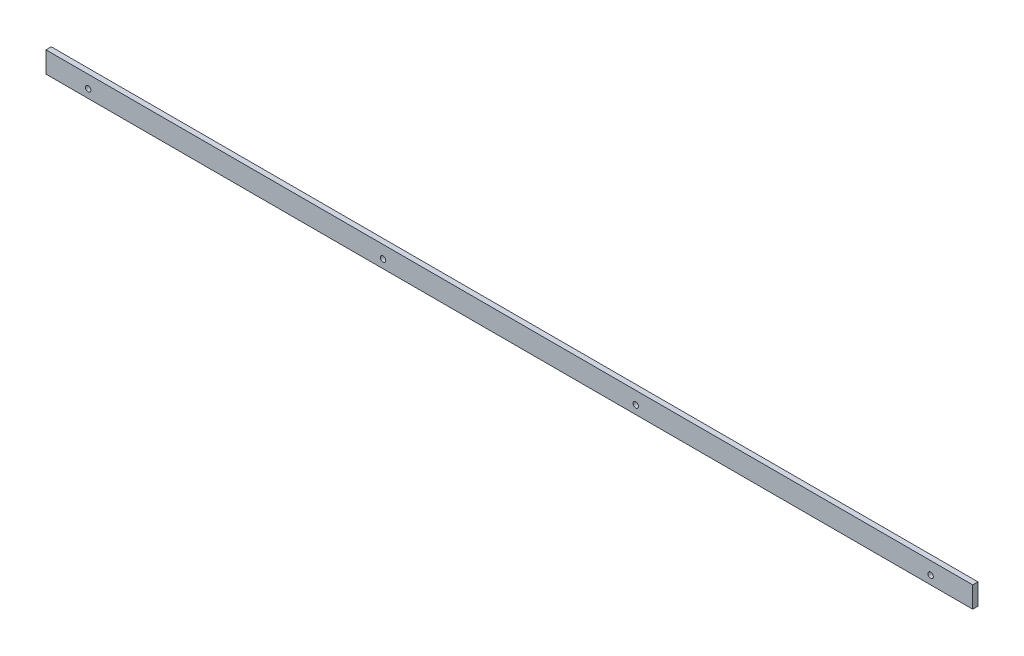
ISO-10303-21;
HEADER;
FILE_DESCRIPTION(('STEP AP214'),'2;1');
FILE_NAME('part.step','',(''),(''),'','','');
FILE_SCHEMA(('AUTOMOTIVE_DESIGN { 1 0 10303 214 1 1 1 1 }'));
ENDSEC;
DATA;
#1=APPLICATION_CONTEXT('core data for automotive mechanical design processes');
#2=APPLICATION_PROTOCOL_DEFINITION('international standard','automotive_design',2000,#1);
#3=PRODUCT_CONTEXT('',#1,'mechanical');
#4=PRODUCT('Part','Part','',(#3));
#5=PRODUCT_RELATED_PRODUCT_CATEGORY('part','',(#4));
#6=PRODUCT_DEFINITION_FORMATION('','',#4);
#7=PRODUCT_DEFINITION_CONTEXT('part definition',#1,'design');
#8=PRODUCT_DEFINITION('design','',#6,#7);
#9=PRODUCT_DEFINITION_SHAPE('','',#8);
#10=(LENGTH_UNIT() NAMED_UNIT(*) SI_UNIT(.MILLI.,.METRE.));
#11=(NAMED_UNIT(*) PLANE_ANGLE_UNIT() SI_UNIT($,.RADIAN.));
#12=(NAMED_UNIT(*) SI_UNIT($,.STERADIAN.) SOLID_ANGLE_UNIT());
#13=UNCERTAINTY_MEASURE_WITH_UNIT(LENGTH_MEASURE(1.E-05),#10,'distance_accuracy_value','');
#14=(GEOMETRIC_REPRESENTATION_CONTEXT(3) GLOBAL_UNCERTAINTY_ASSIGNED_CONTEXT((#13)) GLOBAL_UNIT_ASSIGNED_CONTEXT((#10,
#11,#12)) REPRESENTATION_CONTEXT('',''));
#15=CARTESIAN_POINT('',(0.,0.,0.));
#16=DIRECTION('',(0.,0.,1.));
#17=DIRECTION('',(1.,0.,0.));
#18=AXIS2_PLACEMENT_3D('',#15,#16,#17);
#19=CARTESIAN_POINT('',(-279.4,6.34999999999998,3.175));
#20=DIRECTION('',(1.,0.,0.));
#21=DIRECTION('',(0.,0.,-1.));
#22=AXIS2_PLACEMENT_3D('',#19,#20,#21);
#23=PLANE('',#22);
#24=DIRECTION('',(0.,-1.,0.));
#25=VECTOR('',#24,1.);
#26=CARTESIAN_POINT('',(-279.4,6.34999999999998,0.));
#27=LINE('',#26,#25);
#28=CARTESIAN_POINT('',(-279.4,6.34999999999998,0.));
#29=VERTEX_POINT('',#28);
#30=CARTESIAN_POINT('',(-279.4,-6.35000000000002,0.));
#31=VERTEX_POINT('',#30);
#32=EDGE_CURVE('E98',#29,#31,#27,.T.);
#33=ORIENTED_EDGE('',*,*,#32,.T.);
#34=DIRECTION('',(0.,0.,-1.));
#35=VECTOR('',#34,1.);
#36=CARTESIAN_POINT('',(-279.4,-6.35000000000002,3.175));
#37=LINE('',#36,#35);
#38=CARTESIAN_POINT('',(-279.4,-6.35000000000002,3.175));
#39=VERTEX_POINT('',#38);
#40=EDGE_CURVE('E11',#39,#31,#37,.T.);
#41=ORIENTED_EDGE('',*,*,#40,.F.);
#42=DIRECTION('',(0.,-1.,0.));
#43=VECTOR('',#42,1.);
#44=CARTESIAN_POINT('',(-279.4,6.34999999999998,3.175));
#45=LINE('',#44,#43);
#46=CARTESIAN_POINT('',(-279.4,6.34999999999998,3.175));
#47=VERTEX_POINT('',#46);
#48=EDGE_CURVE('E86',#47,#39,#45,.T.);
#49=ORIENTED_EDGE('',*,*,#48,.F.);
#50=DIRECTION('',(0.,0.,-1.));
#51=VECTOR('',#50,1.);
#52=CARTESIAN_POINT('',(-279.4,6.34999999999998,3.175));
#53=LINE('',#52,#51);
#54=EDGE_CURVE('E94',#47,#29,#53,.T.);
#55=ORIENTED_EDGE('',*,*,#54,.T.);
#56=EDGE_LOOP('',(#33,#41,#49,#55));
#57=FACE_BOUND('',#56,.T.);
#58=ADVANCED_FACE('F35',(#57),#23,.F.);
#59=CARTESIAN_POINT('',(-279.4,-6.35000000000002,3.175));
#60=DIRECTION('',(0.,1.,0.));
#61=DIRECTION('',(0.,0.,1.));
#62=AXIS2_PLACEMENT_3D('',#59,#60,#61);
#63=PLANE('',#62);
#64=DIRECTION('',(1.,0.,0.));
#65=VECTOR('',#64,1.);
#66=CARTESIAN_POINT('',(-279.4,-6.35000000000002,0.));
#67=LINE('',#66,#65);
#68=CARTESIAN_POINT('',(279.4,-6.35000000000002,0.));
#69=VERTEX_POINT('',#68);
#70=EDGE_CURVE('E90',#31,#69,#67,.T.);
#71=ORIENTED_EDGE('',*,*,#70,.T.);
#72=DIRECTION('',(0.,0.,-1.));
#73=VECTOR('',#72,1.);
#74=CARTESIAN_POINT('',(279.4,-6.35000000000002,3.175));
#75=LINE('',#74,#73);
#76=CARTESIAN_POINT('',(279.4,-6.35000000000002,3.175));
#77=VERTEX_POINT('',#76);
#78=EDGE_CURVE('E43',#77,#69,#75,.T.);
#79=ORIENTED_EDGE('',*,*,#78,.F.);
#80=DIRECTION('',(1.,0.,0.));
#81=VECTOR('',#80,1.);
#82=CARTESIAN_POINT('',(-279.4,-6.35000000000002,3.175));
#83=LINE('',#82,#81);
#84=EDGE_CURVE('E81',#39,#77,#83,.T.);
#85=ORIENTED_EDGE('',*,*,#84,.F.);
#86=ORIENTED_EDGE('',*,*,#40,.T.);
#87=EDGE_LOOP('',(#71,#79,#85,#86));
#88=FACE_BOUND('',#87,.T.);
#89=ADVANCED_FACE('F89',(#88),#63,.F.);
#90=CARTESIAN_POINT('',(279.4,6.34999999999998,3.175));
#91=DIRECTION('',(-1.,0.,0.));
#92=DIRECTION('',(0.,0.,1.));
#93=AXIS2_PLACEMENT_3D('',#90,#91,#92);
#94=PLANE('',#93);
#95=DIRECTION('',(0.,1.,0.));
#96=VECTOR('',#95,1.);
#97=CARTESIAN_POINT('',(279.4,6.34999999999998,0.));
#98=LINE('',#97,#96);
#99=CARTESIAN_POINT('',(279.4,6.34999999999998,0.));
#100=VERTEX_POINT('',#99);
#101=EDGE_CURVE('E68',#69,#100,#98,.T.);
#102=ORIENTED_EDGE('',*,*,#101,.T.);
#103=DIRECTION('',(0.,0.,-1.));
#104=VECTOR('',#103,1.);
#105=CARTESIAN_POINT('',(279.4,6.34999999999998,3.175));
#106=LINE('',#105,#104);
#107=CARTESIAN_POINT('',(279.4,6.34999999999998,3.175));
#108=VERTEX_POINT('',#107);
#109=EDGE_CURVE('E91',#108,#100,#106,.T.);
#110=ORIENTED_EDGE('',*,*,#109,.F.);
#111=DIRECTION('',(0.,1.,0.));
#112=VECTOR('',#111,1.);
#113=CARTESIAN_POINT('',(279.4,6.34999999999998,3.175));
#114=LINE('',#113,#112);
#115=EDGE_CURVE('E84',#77,#108,#114,.T.);
#116=ORIENTED_EDGE('',*,*,#115,.F.);
#117=ORIENTED_EDGE('',*,*,#78,.T.);
#118=EDGE_LOOP('',(#102,#110,#116,#117));
#119=FACE_BOUND('',#118,.T.);
#120=ADVANCED_FACE('F92',(#119),#94,.F.);
#121=CARTESIAN_POINT('',(-279.4,6.34999999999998,3.175));
#122=DIRECTION('',(0.,-1.,0.));
#123=DIRECTION('',(0.,0.,-1.));
#124=AXIS2_PLACEMENT_3D('',#121,#122,#123);
#125=PLANE('',#124);
#126=DIRECTION('',(-1.,0.,0.));
#127=VECTOR('',#126,1.);
#128=CARTESIAN_POINT('',(-279.4,6.34999999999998,0.));
#129=LINE('',#128,#127);
#130=EDGE_CURVE('E74',#100,#29,#129,.T.);
#131=ORIENTED_EDGE('',*,*,#130,.T.);
#132=ORIENTED_EDGE('',*,*,#54,.F.);
#133=DIRECTION('',(-1.,0.,0.));
#134=VECTOR('',#133,1.);
#135=CARTESIAN_POINT('',(-279.4,6.34999999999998,3.175));
#136=LINE('',#135,#134);
#137=EDGE_CURVE('E51',#108,#47,#136,.T.);
#138=ORIENTED_EDGE('',*,*,#137,.F.);
#139=ORIENTED_EDGE('',*,*,#109,.T.);
#140=EDGE_LOOP('',(#131,#132,#138,#139));
#141=FACE_BOUND('',#140,.T.);
#142=ADVANCED_FACE('F106',(#141),#125,.F.);
#143=CARTESIAN_POINT('',(0.,0.,3.175));
#144=DIRECTION('',(0.,0.,1.));
#145=DIRECTION('',(1.,0.,0.));
#146=AXIS2_PLACEMENT_3D('',#143,#144,#145);
#147=PLANE('',#146);
#148=CARTESIAN_POINT('',(-254.,-1.27000000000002,3.175));
#149=DIRECTION('',(0.,0.,1.));
#150=DIRECTION('',(1.,0.,0.));
#151=AXIS2_PLACEMENT_3D('',#148,#149,#150);
#152=CIRCLE('',#151,1.63194999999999);
#153=CARTESIAN_POINT('',(-252.36805,-1.27000000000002,3.175));
#154=VERTEX_POINT('',#153);
#155=EDGE_CURVE('E132',#154,#154,#152,.T.);
#156=ORIENTED_EDGE('',*,*,#155,.F.);
#157=EDGE_LOOP('',(#156));
#158=FACE_BOUND('',#157,.T.);
#159=CARTESIAN_POINT('',(-76.2,-1.27000000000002,3.175));
#160=DIRECTION('',(0.,0.,1.));
#161=DIRECTION('',(1.,0.,0.));
#162=AXIS2_PLACEMENT_3D('',#159,#160,#161);
#163=CIRCLE('',#162,1.63194999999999);
#164=CARTESIAN_POINT('',(-74.56805,-1.27000000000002,3.175));
#165=VERTEX_POINT('',#164);
#166=EDGE_CURVE('E126',#165,#165,#163,.T.);
#167=ORIENTED_EDGE('',*,*,#166,.F.);
#168=EDGE_LOOP('',(#167));
#169=FACE_BOUND('',#168,.T.);
#170=CARTESIAN_POINT('',(76.2,-1.27000000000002,3.175));
#171=DIRECTION('',(0.,0.,1.));
#172=DIRECTION('',(1.,0.,0.));
#173=AXIS2_PLACEMENT_3D('',#170,#171,#172);
#174=CIRCLE('',#173,1.63194999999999);
#175=CARTESIAN_POINT('',(77.83195,-1.27000000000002,3.175));
#176=VERTEX_POINT('',#175);
#177=EDGE_CURVE('E120',#176,#176,#174,.T.);
#178=ORIENTED_EDGE('',*,*,#177,.F.);
#179=EDGE_LOOP('',(#178));
#180=FACE_BOUND('',#179,.T.);
#181=CARTESIAN_POINT('',(254.,-1.27000000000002,3.175));
#182=DIRECTION('',(0.,0.,1.));
#183=DIRECTION('',(1.,0.,0.));
#184=AXIS2_PLACEMENT_3D('',#181,#182,#183);
#185=CIRCLE('',#184,1.63194999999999);
#186=CARTESIAN_POINT('',(255.63195,-1.27000000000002,3.175));
#187=VERTEX_POINT('',#186);
#188=EDGE_CURVE('E114',#187,#187,#185,.T.);
#189=ORIENTED_EDGE('',*,*,#188,.F.);
#190=EDGE_LOOP('',(#189));
#191=FACE_BOUND('',#190,.T.);
#192=ORIENTED_EDGE('',*,*,#48,.T.);
#193=ORIENTED_EDGE('',*,*,#84,.T.);
#194=ORIENTED_EDGE('',*,*,#115,.T.);
#195=ORIENTED_EDGE('',*,*,#137,.T.);
#196=EDGE_LOOP('',(#192,#193,#194,#195));
#197=FACE_BOUND('',#196,.T.);
#198=ADVANCED_FACE('F82',(#158,#169,#180,#191,#197),#147,.T.);
#199=CARTESIAN_POINT('',(0.,0.,0.));
#200=DIRECTION('',(0.,0.,1.));
#201=DIRECTION('',(1.,0.,0.));
#202=AXIS2_PLACEMENT_3D('',#199,#200,#201);
#203=PLANE('',#202);
#204=CARTESIAN_POINT('',(-254.,-1.27000000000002,0.));
#205=DIRECTION('',(0.,0.,1.));
#206=DIRECTION('',(1.,0.,0.));
#207=AXIS2_PLACEMENT_3D('',#204,#205,#206);
#208=CIRCLE('',#207,1.63194999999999);
#209=CARTESIAN_POINT('',(-252.36805,-1.27000000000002,0.));
#210=VERTEX_POINT('',#209);
#211=EDGE_CURVE('E129',#210,#210,#208,.T.);
#212=ORIENTED_EDGE('',*,*,#211,.T.);
#213=EDGE_LOOP('',(#212));
#214=FACE_BOUND('',#213,.T.);
#215=CARTESIAN_POINT('',(-76.2,-1.27000000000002,0.));
#216=DIRECTION('',(0.,0.,1.));
#217=DIRECTION('',(1.,0.,0.));
#218=AXIS2_PLACEMENT_3D('',#215,#216,#217);
#219=CIRCLE('',#218,1.63194999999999);
#220=CARTESIAN_POINT('',(-74.56805,-1.27000000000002,0.));
#221=VERTEX_POINT('',#220);
#222=EDGE_CURVE('E123',#221,#221,#219,.T.);
#223=ORIENTED_EDGE('',*,*,#222,.T.);
#224=EDGE_LOOP('',(#223));
#225=FACE_BOUND('',#224,.T.);
#226=CARTESIAN_POINT('',(76.2,-1.27000000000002,0.));
#227=DIRECTION('',(0.,0.,1.));
#228=DIRECTION('',(1.,0.,0.));
#229=AXIS2_PLACEMENT_3D('',#226,#227,#228);
#230=CIRCLE('',#229,1.63194999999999);
#231=CARTESIAN_POINT('',(77.83195,-1.27000000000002,0.));
#232=VERTEX_POINT('',#231);
#233=EDGE_CURVE('E117',#232,#232,#230,.T.);
#234=ORIENTED_EDGE('',*,*,#233,.T.);
#235=EDGE_LOOP('',(#234));
#236=FACE_BOUND('',#235,.T.);
#237=CARTESIAN_POINT('',(254.,-1.27000000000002,0.));
#238=DIRECTION('',(0.,0.,1.));
#239=DIRECTION('',(1.,0.,0.));
#240=AXIS2_PLACEMENT_3D('',#237,#238,#239);
#241=CIRCLE('',#240,1.63194999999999);
#242=CARTESIAN_POINT('',(255.63195,-1.27000000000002,0.));
#243=VERTEX_POINT('',#242);
#244=EDGE_CURVE('E101',#243,#243,#241,.T.);
#245=ORIENTED_EDGE('',*,*,#244,.T.);
#246=EDGE_LOOP('',(#245));
#247=FACE_BOUND('',#246,.T.);
#248=ORIENTED_EDGE('',*,*,#32,.F.);
#249=ORIENTED_EDGE('',*,*,#130,.F.);
#250=ORIENTED_EDGE('',*,*,#101,.F.);
#251=ORIENTED_EDGE('',*,*,#70,.F.);
#252=EDGE_LOOP('',(#248,#249,#250,#251));
#253=FACE_BOUND('',#252,.T.);
#254=ADVANCED_FACE('F109',(#214,#225,#236,#247,#253),#203,.F.);
#255=CARTESIAN_POINT('',(254.,-1.27000000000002,3.175));
#256=DIRECTION('',(0.,0.,1.));
#257=DIRECTION('',(1.,0.,0.));
#258=AXIS2_PLACEMENT_3D('',#255,#256,#257);
#259=CYLINDRICAL_SURFACE('',#258,1.63194999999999);
#260=ORIENTED_EDGE('',*,*,#244,.F.);
#261=EDGE_LOOP('',(#260));
#262=FACE_BOUND('',#261,.T.);
#263=ORIENTED_EDGE('',*,*,#188,.T.);
#264=EDGE_LOOP('',(#263));
#265=FACE_BOUND('',#264,.T.);
#266=ADVANCED_FACE('F147',(#262,#265),#259,.F.);
#267=CARTESIAN_POINT('',(76.2,-1.27000000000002,3.175));
#268=DIRECTION('',(0.,0.,1.));
#269=DIRECTION('',(1.,0.,0.));
#270=AXIS2_PLACEMENT_3D('',#267,#268,#269);
#271=CYLINDRICAL_SURFACE('',#270,1.63194999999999);
#272=ORIENTED_EDGE('',*,*,#233,.F.);
#273=EDGE_LOOP('',(#272));
#274=FACE_BOUND('',#273,.T.);
#275=ORIENTED_EDGE('',*,*,#177,.T.);
#276=EDGE_LOOP('',(#275));
#277=FACE_BOUND('',#276,.T.);
#278=ADVANCED_FACE('F149',(#274,#277),#271,.F.);
#279=CARTESIAN_POINT('',(-76.2,-1.27000000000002,3.175));
#280=DIRECTION('',(0.,0.,1.));
#281=DIRECTION('',(1.,0.,0.));
#282=AXIS2_PLACEMENT_3D('',#279,#280,#281);
#283=CYLINDRICAL_SURFACE('',#282,1.63194999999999);
#284=ORIENTED_EDGE('',*,*,#222,.F.);
#285=EDGE_LOOP('',(#284));
#286=FACE_BOUND('',#285,.T.);
#287=ORIENTED_EDGE('',*,*,#166,.T.);
#288=EDGE_LOOP('',(#287));
#289=FACE_BOUND('',#288,.T.);
#290=ADVANCED_FACE('F156',(#286,#289),#283,.F.);
#291=CARTESIAN_POINT('',(-254.,-1.27000000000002,3.175));
#292=DIRECTION('',(0.,0.,1.));
#293=DIRECTION('',(1.,0.,0.));
#294=AXIS2_PLACEMENT_3D('',#291,#292,#293);
#295=CYLINDRICAL_SURFACE('',#294,1.63194999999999);
#296=ORIENTED_EDGE('',*,*,#211,.F.);
#297=EDGE_LOOP('',(#296));
#298=FACE_BOUND('',#297,.T.);
#299=ORIENTED_EDGE('',*,*,#155,.T.);
#300=EDGE_LOOP('',(#299));
#301=FACE_BOUND('',#300,.T.);
#302=ADVANCED_FACE('F136',(#298,#301),#295,.F.);
#303=CLOSED_SHELL('',(#58,#89,#120,#142,#198,#254,#266,#278,#290,#302));
#304=MANIFOLD_SOLID_BREP('B2',#303);
#305=ADVANCED_BREP_SHAPE_REPRESENTATION('',(#18,#304),#14);
#306=SHAPE_DEFINITION_REPRESENTATION(#9,#305);
ENDSEC;
END-ISO-10303-21;
